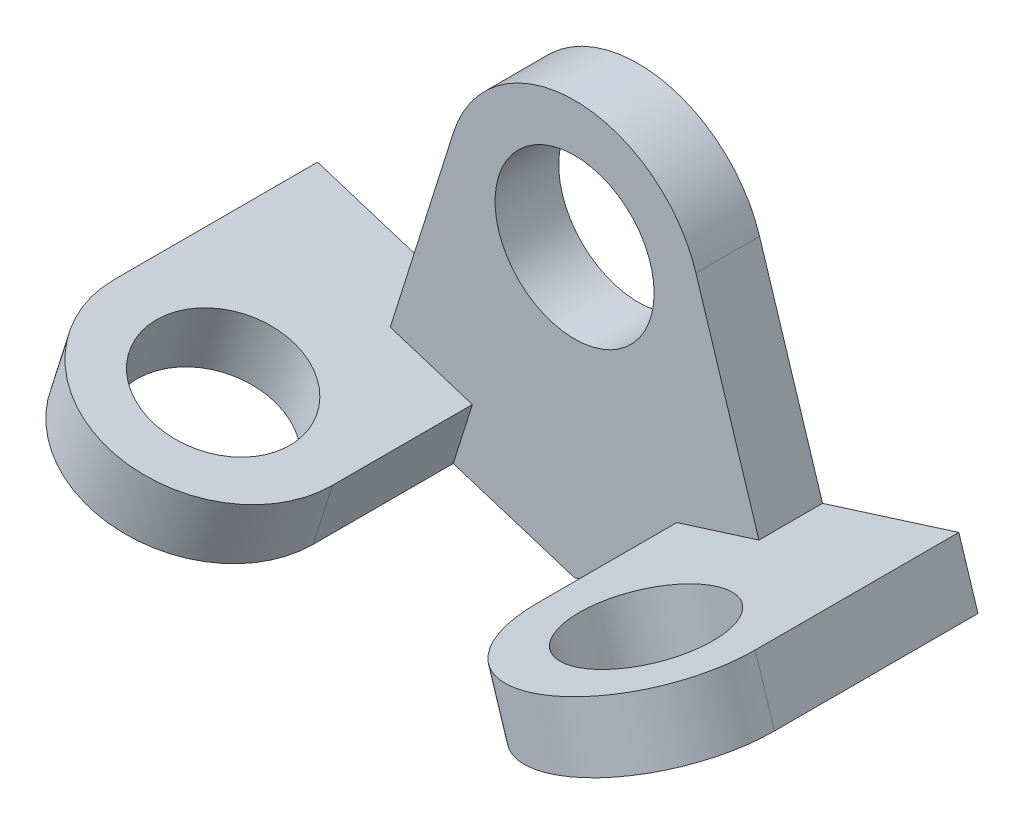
from build123d import *

# Parameters (mm, degrees)
SKETCH1_R           = 12.5
BOSS_EXTRUDE1_DEPTH = 10
BOSS_EXTRUDE5_DEPTH = 32
BOSS_EXTRUDE6_DEPTH = 10
SKETCH8_R           = 11
CUT_EXTRUDE3_DEPTH  = 94.588467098
BOSS_EXTRUDE7_DEPTH = 10
SKETCH10_R          = 11
CUT_EXTRUDE4_DEPTH  = 94.588467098


with BuildPart() as part:
    # Sketch1 → Boss-Extrude1 (new body)
    with BuildSketch(Plane.XY):
        with BuildLine():
            Line((-31.979808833, 10.083194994), (-19.074339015, 51.01411599))
            ThreePointArc((-19.074339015, 51.01411599), (0, 65), (19.074339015, 51.01411599))
            Line((19.074339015, 51.01411599), (31.979808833, 10.083194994))
            Line((31.979808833, 10.083194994), (0, 0))
            Line((0, 0), (-31.979808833, 10.083194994))
        make_face()
        with Locations((0, 45)):
            Circle(SKETCH1_R, mode=Mode.SUBTRACT)
    extrude(amount=BOSS_EXTRUDE1_DEPTH)

    # Sketch2 → Boss-Extrude5 (add)
    with BuildSketch(Plane(origin=(0, 0, 0), x_dir=(-1, 0, 0), z_dir=(0, 0, -1))):
        Polygon((19.074339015, 6.01411599), (16.06728102, 15.551285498), (50.401091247, 26.37669428), (53.408149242, 16.839524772), align=None)
        Polygon((-19.074339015, 6.01411599), (-16.06728102, 15.551285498), (-50.401091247, 26.37669428), (-53.408149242, 16.839524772), align=None)
    extrude(amount=-BOSS_EXTRUDE5_DEPTH)

    # Sketch7 → Boss-Extrude6 (add)
    with BuildSketch(Plane(origin=(-3.007057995, 9.537169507, 0), x_dir=(0.9537169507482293, 0.30070579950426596, 0), z_dir=(-0.3007057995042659, 0.9537169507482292, 0))):
        with BuildLine():
            Line((20, -32), (56, -32))
            ThreePointArc((56, -32), (38, -50), (20, -32))
        make_face()
    extrude(amount=-BOSS_EXTRUDE6_DEPTH)

    # Sketch8 → Cut-Extrude3 (cut, through all)
    with BuildSketch(Plane(origin=(-3.007057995, 9.537169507, 0), x_dir=(0.9537169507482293, 0.30070579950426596, 0), z_dir=(-0.3007057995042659, 0.9537169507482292, 0))):
        with Locations(Location((38, -32, 0), (0, 0, 180))):
            Circle(SKETCH8_R)
    extrude(amount=-CUT_EXTRUDE3_DEPTH, mode=Mode.SUBTRACT)

    # Sketch9 → Boss-Extrude7 (add)
    with BuildSketch(Plane(origin=(3.007057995, 9.537169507, 0), x_dir=(0.9537169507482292, -0.30070579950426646, 0), z_dir=(0.30070579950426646, 0.9537169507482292, 0))):
        with BuildLine():
            Line((-56, -32), (-20, -32))
            ThreePointArc((-20, -32), (-38, -50), (-56, -32))
        make_face()
    extrude(amount=-BOSS_EXTRUDE7_DEPTH)

    # Sketch10 → Cut-Extrude4 (cut, through all)
    with BuildSketch(Plane(origin=(3.007057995, 9.537169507, 0), x_dir=(0.9537169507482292, -0.30070579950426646, 0), z_dir=(0.30070579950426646, 0.9537169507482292, 0))):
        with Locations(Location((-38, -32, 0), (0, 0, 180))):
            Circle(SKETCH10_R)
    extrude(amount=-CUT_EXTRUDE4_DEPTH, mode=Mode.SUBTRACT)


solid = part.part
